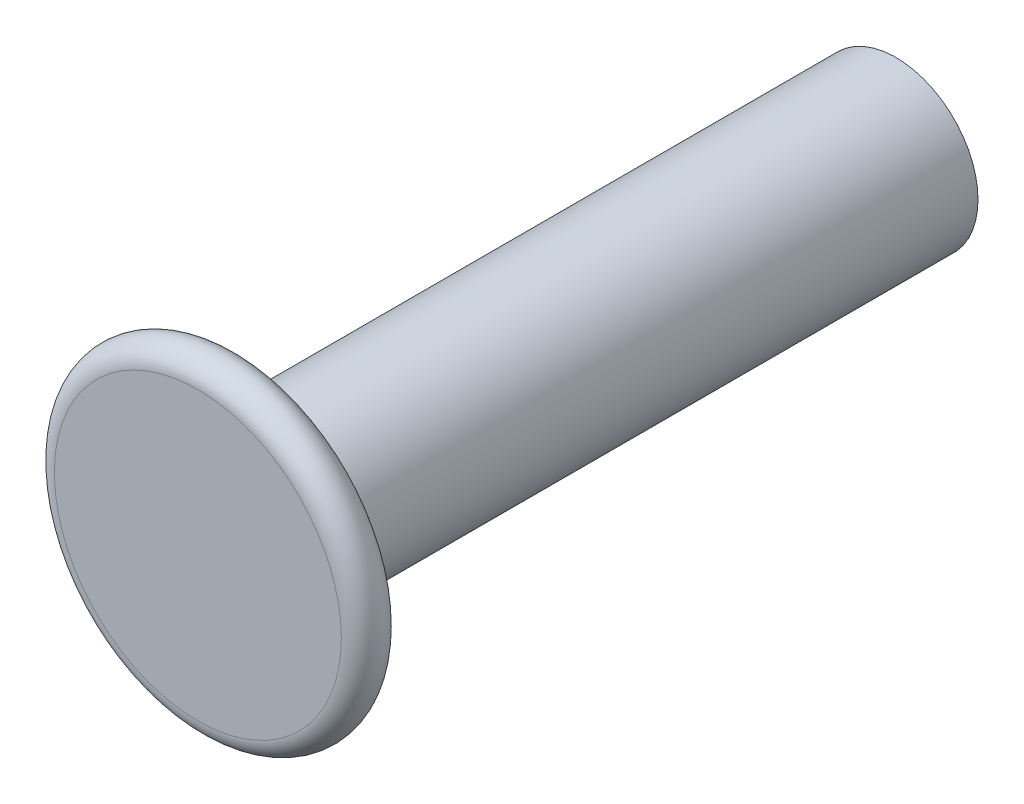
ISO-10303-21;
HEADER;
FILE_DESCRIPTION(('STEP AP214'),'2;1');
FILE_NAME('part.step','',(''),(''),'','','');
FILE_SCHEMA(('AUTOMOTIVE_DESIGN { 1 0 10303 214 1 1 1 1 }'));
ENDSEC;
DATA;
#1=APPLICATION_CONTEXT('core data for automotive mechanical design processes');
#2=APPLICATION_PROTOCOL_DEFINITION('international standard','automotive_design',2000,#1);
#3=PRODUCT_CONTEXT('',#1,'mechanical');
#4=PRODUCT('Part','Part','',(#3));
#5=PRODUCT_RELATED_PRODUCT_CATEGORY('part','',(#4));
#6=PRODUCT_DEFINITION_FORMATION('','',#4);
#7=PRODUCT_DEFINITION_CONTEXT('part definition',#1,'design');
#8=PRODUCT_DEFINITION('design','',#6,#7);
#9=PRODUCT_DEFINITION_SHAPE('','',#8);
#10=(LENGTH_UNIT() NAMED_UNIT(*) SI_UNIT(.MILLI.,.METRE.));
#11=(NAMED_UNIT(*) PLANE_ANGLE_UNIT() SI_UNIT($,.RADIAN.));
#12=(NAMED_UNIT(*) SI_UNIT($,.STERADIAN.) SOLID_ANGLE_UNIT());
#13=UNCERTAINTY_MEASURE_WITH_UNIT(LENGTH_MEASURE(1.E-05),#10,'distance_accuracy_value','');
#14=(GEOMETRIC_REPRESENTATION_CONTEXT(3) GLOBAL_UNCERTAINTY_ASSIGNED_CONTEXT((#13)) GLOBAL_UNIT_ASSIGNED_CONTEXT((#10,
#11,#12)) REPRESENTATION_CONTEXT('',''));
#15=CARTESIAN_POINT('',(0.,0.,0.));
#16=DIRECTION('',(0.,0.,1.));
#17=DIRECTION('',(1.,0.,0.));
#18=AXIS2_PLACEMENT_3D('',#15,#16,#17);
#19=CARTESIAN_POINT('',(0.,0.,-27.0002));
#20=DIRECTION('',(0.,0.,1.));
#21=DIRECTION('',(1.,0.,0.));
#22=AXIS2_PLACEMENT_3D('',#19,#20,#21);
#23=PLANE('',#22);
#24=CARTESIAN_POINT('',(0.,0.,-27.0002));
#25=DIRECTION('',(0.,0.,1.));
#26=DIRECTION('',(1.,0.,0.));
#27=AXIS2_PLACEMENT_3D('',#24,#25,#26);
#28=CIRCLE('',#27,3.175);
#29=CARTESIAN_POINT('',(3.175,0.,-27.0002));
#30=VERTEX_POINT('',#29);
#31=EDGE_CURVE('E10',#30,#30,#28,.T.);
#32=ORIENTED_EDGE('',*,*,#31,.F.);
#33=EDGE_LOOP('',(#32));
#34=FACE_BOUND('',#33,.T.);
#35=ADVANCED_FACE('F40',(#34),#23,.F.);
#36=CARTESIAN_POINT('',(0.,0.,0.));
#37=DIRECTION('',(0.,0.,1.));
#38=DIRECTION('',(1.,0.,0.));
#39=AXIS2_PLACEMENT_3D('',#36,#37,#38);
#40=CYLINDRICAL_SURFACE('',#39,3.175);
#41=CARTESIAN_POINT('',(0.,0.,-1.6002));
#42=DIRECTION('',(0.,0.,1.));
#43=DIRECTION('',(1.,0.,0.));
#44=AXIS2_PLACEMENT_3D('',#41,#42,#43);
#45=CIRCLE('',#44,3.175);
#46=CARTESIAN_POINT('',(3.175,0.,-1.6002));
#47=VERTEX_POINT('',#46);
#48=EDGE_CURVE('E43',#47,#47,#45,.T.);
#49=ORIENTED_EDGE('',*,*,#48,.F.);
#50=EDGE_LOOP('',(#49));
#51=FACE_BOUND('',#50,.T.);
#52=ORIENTED_EDGE('',*,*,#31,.T.);
#53=EDGE_LOOP('',(#52));
#54=FACE_BOUND('',#53,.T.);
#55=ADVANCED_FACE('F70',(#51,#54),#40,.T.);
#56=CARTESIAN_POINT('',(-5.5499,0.,-1.6002));
#57=DIRECTION('',(0.,0.,1.));
#58=DIRECTION('',(1.,0.,0.));
#59=AXIS2_PLACEMENT_3D('',#56,#57,#58);
#60=PLANE('',#59);
#61=CARTESIAN_POINT('',(0.,0.,-1.6002));
#62=DIRECTION('',(0.,0.,1.));
#63=DIRECTION('',(1.,0.,0.));
#64=AXIS2_PLACEMENT_3D('',#61,#62,#63);
#65=CIRCLE('',#64,5.5499);
#66=CARTESIAN_POINT('',(5.5499,0.,-1.6002));
#67=VERTEX_POINT('',#66);
#68=EDGE_CURVE('E50',#67,#67,#65,.T.);
#69=ORIENTED_EDGE('',*,*,#68,.F.);
#70=EDGE_LOOP('',(#69));
#71=FACE_BOUND('',#70,.T.);
#72=ORIENTED_EDGE('',*,*,#48,.T.);
#73=EDGE_LOOP('',(#72));
#74=FACE_BOUND('',#73,.T.);
#75=ADVANCED_FACE('F65',(#71,#74),#60,.F.);
#76=CARTESIAN_POINT('',(0.,0.,-0.8001));
#77=DIRECTION('',(0.,0.,1.));
#78=DIRECTION('',(1.,0.,0.));
#79=AXIS2_PLACEMENT_3D('',#76,#77,#78);
#80=TOROIDAL_SURFACE('',#79,5.5499,0.8001);
#81=CARTESIAN_POINT('',(0.,0.,0.));
#82=DIRECTION('',(0.,0.,1.));
#83=DIRECTION('',(1.,0.,0.));
#84=AXIS2_PLACEMENT_3D('',#81,#82,#83);
#85=CIRCLE('',#84,5.5499);
#86=CARTESIAN_POINT('',(5.5499,0.,0.));
#87=VERTEX_POINT('',#86);
#88=EDGE_CURVE('E51',#87,#87,#85,.T.);
#89=ORIENTED_EDGE('',*,*,#88,.F.);
#90=EDGE_LOOP('',(#89));
#91=FACE_BOUND('',#90,.T.);
#92=ORIENTED_EDGE('',*,*,#68,.T.);
#93=EDGE_LOOP('',(#92));
#94=FACE_BOUND('',#93,.T.);
#95=ADVANCED_FACE('F56',(#91,#94),#80,.T.);
#96=CARTESIAN_POINT('',(0.,0.,0.));
#97=DIRECTION('',(0.,0.,-1.));
#98=DIRECTION('',(-1.,0.,0.));
#99=AXIS2_PLACEMENT_3D('',#96,#97,#98);
#100=PLANE('',#99);
#101=ORIENTED_EDGE('',*,*,#88,.T.);
#102=EDGE_LOOP('',(#101));
#103=FACE_BOUND('',#102,.T.);
#104=ADVANCED_FACE('F60',(#103),#100,.F.);
#105=CLOSED_SHELL('',(#35,#55,#75,#95,#104));
#106=MANIFOLD_SOLID_BREP('B2',#105);
#107=ADVANCED_BREP_SHAPE_REPRESENTATION('',(#18,#106),#14);
#108=SHAPE_DEFINITION_REPRESENTATION(#9,#107);
ENDSEC;
END-ISO-10303-21;
